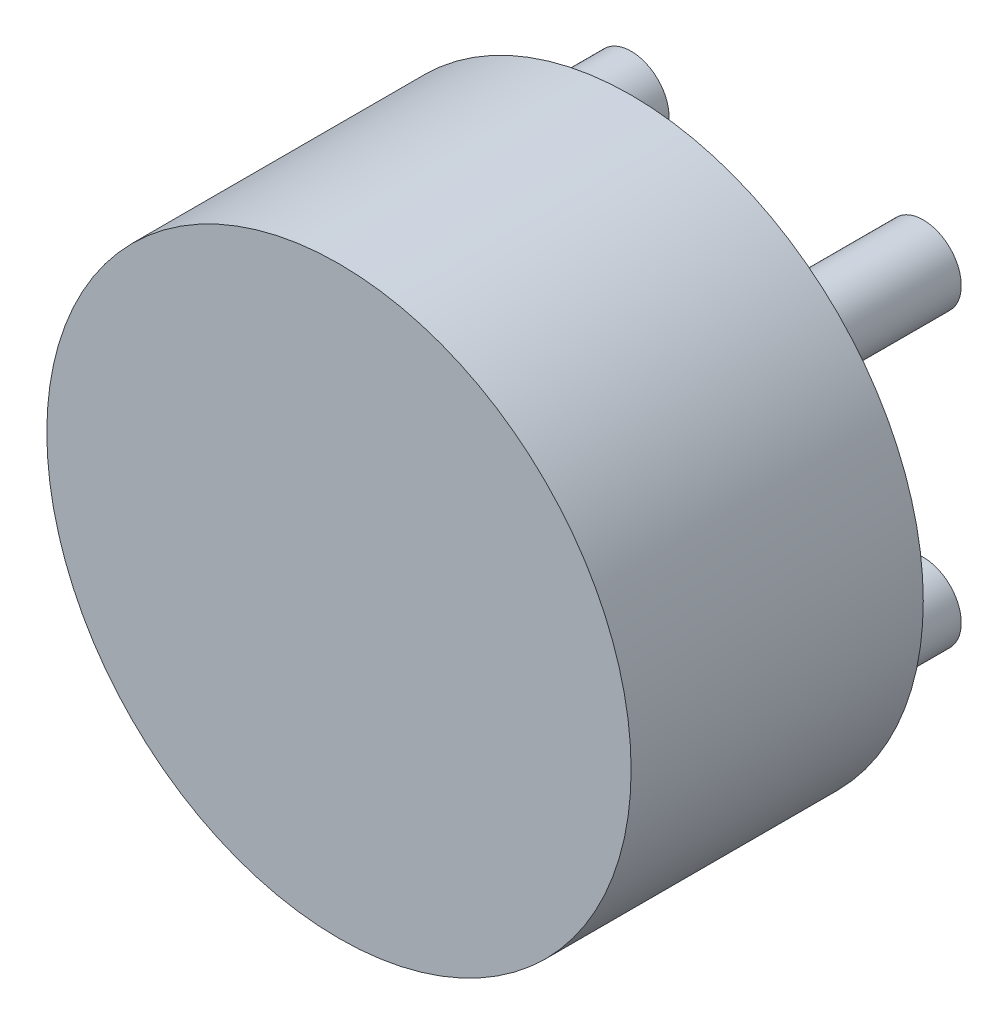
ISO-10303-21;
HEADER;
FILE_DESCRIPTION(('STEP AP214'),'2;1');
FILE_NAME('part.step','',(''),(''),'','','');
FILE_SCHEMA(('AUTOMOTIVE_DESIGN { 1 0 10303 214 1 1 1 1 }'));
ENDSEC;
DATA;
#1=APPLICATION_CONTEXT('core data for automotive mechanical design processes');
#2=APPLICATION_PROTOCOL_DEFINITION('international standard','automotive_design',2000,#1);
#3=PRODUCT_CONTEXT('',#1,'mechanical');
#4=PRODUCT('Part','Part','',(#3));
#5=PRODUCT_RELATED_PRODUCT_CATEGORY('part','',(#4));
#6=PRODUCT_DEFINITION_FORMATION('','',#4);
#7=PRODUCT_DEFINITION_CONTEXT('part definition',#1,'design');
#8=PRODUCT_DEFINITION('design','',#6,#7);
#9=PRODUCT_DEFINITION_SHAPE('','',#8);
#10=(LENGTH_UNIT() NAMED_UNIT(*) SI_UNIT(.MILLI.,.METRE.));
#11=(NAMED_UNIT(*) PLANE_ANGLE_UNIT() SI_UNIT($,.RADIAN.));
#12=(NAMED_UNIT(*) SI_UNIT($,.STERADIAN.) SOLID_ANGLE_UNIT());
#13=UNCERTAINTY_MEASURE_WITH_UNIT(LENGTH_MEASURE(1.E-05),#10,'distance_accuracy_value','');
#14=(GEOMETRIC_REPRESENTATION_CONTEXT(3) GLOBAL_UNCERTAINTY_ASSIGNED_CONTEXT((#13)) GLOBAL_UNIT_ASSIGNED_CONTEXT((#10,
#11,#12)) REPRESENTATION_CONTEXT('',''));
#15=CARTESIAN_POINT('',(0.,0.,0.));
#16=DIRECTION('',(0.,0.,1.));
#17=DIRECTION('',(1.,0.,0.));
#18=AXIS2_PLACEMENT_3D('',#15,#16,#17);
#19=CARTESIAN_POINT('',(-2.54,-2.54,-2.54));
#20=DIRECTION('',(0.,0.,1.));
#21=DIRECTION('',(1.,0.,0.));
#22=AXIS2_PLACEMENT_3D('',#19,#20,#21);
#23=CYLINDRICAL_SURFACE('',#22,0.6604);
#24=CARTESIAN_POINT('',(-2.54,-2.54,-2.54));
#25=DIRECTION('',(0.,0.,-1.));
#26=DIRECTION('',(-1.,0.,0.));
#27=AXIS2_PLACEMENT_3D('',#24,#25,#26);
#28=CIRCLE('',#27,0.6604);
#29=CARTESIAN_POINT('',(-3.2004,-2.54,-2.54));
#30=VERTEX_POINT('',#29);
#31=EDGE_CURVE('E11',#30,#30,#28,.T.);
#32=ORIENTED_EDGE('',*,*,#31,.F.);
#33=EDGE_LOOP('',(#32));
#34=FACE_BOUND('',#33,.T.);
#35=CARTESIAN_POINT('',(-2.54,-2.54,0.));
#36=DIRECTION('',(0.,0.,-1.));
#37=DIRECTION('',(-1.,0.,0.));
#38=AXIS2_PLACEMENT_3D('',#35,#36,#37);
#39=CIRCLE('',#38,0.6604);
#40=CARTESIAN_POINT('',(-3.2004,-2.54,0.));
#41=VERTEX_POINT('',#40);
#42=EDGE_CURVE('E41',#41,#41,#39,.T.);
#43=ORIENTED_EDGE('',*,*,#42,.T.);
#44=EDGE_LOOP('',(#43));
#45=FACE_BOUND('',#44,.T.);
#46=ADVANCED_FACE('F38',(#34,#45),#23,.T.);
#47=CARTESIAN_POINT('',(-2.54,-2.54,-2.54));
#48=DIRECTION('',(0.,0.,-1.));
#49=DIRECTION('',(-1.,0.,0.));
#50=AXIS2_PLACEMENT_3D('',#47,#48,#49);
#51=PLANE('',#50);
#52=ORIENTED_EDGE('',*,*,#31,.T.);
#53=EDGE_LOOP('',(#52));
#54=FACE_BOUND('',#53,.T.);
#55=ADVANCED_FACE('F53',(#54),#51,.T.);
#56=CARTESIAN_POINT('',(-2.54,-2.54,0.));
#57=DIRECTION('',(0.,0.,-1.));
#58=DIRECTION('',(-1.,0.,0.));
#59=AXIS2_PLACEMENT_3D('',#56,#57,#58);
#60=PLANE('',#59);
#61=ORIENTED_EDGE('',*,*,#42,.F.);
#62=EDGE_LOOP('',(#61));
#63=FACE_BOUND('',#62,.T.);
#64=ADVANCED_FACE('F51',(#63),#60,.F.);
#65=CLOSED_SHELL('',(#46,#55,#64));
#66=MANIFOLD_SOLID_BREP('B2',#65);
#67=CARTESIAN_POINT('',(2.54,-2.54,-2.54));
#68=DIRECTION('',(0.,0.,1.));
#69=DIRECTION('',(1.,0.,0.));
#70=AXIS2_PLACEMENT_3D('',#67,#68,#69);
#71=CYLINDRICAL_SURFACE('',#70,0.6604);
#72=CARTESIAN_POINT('',(2.54,-2.54,-2.54));
#73=DIRECTION('',(0.,0.,-1.));
#74=DIRECTION('',(-1.,0.,0.));
#75=AXIS2_PLACEMENT_3D('',#72,#73,#74);
#76=CIRCLE('',#75,0.6604);
#77=CARTESIAN_POINT('',(1.8796,-2.54,-2.54));
#78=VERTEX_POINT('',#77);
#79=EDGE_CURVE('E37',#78,#78,#76,.T.);
#80=ORIENTED_EDGE('',*,*,#79,.F.);
#81=EDGE_LOOP('',(#80));
#82=FACE_BOUND('',#81,.T.);
#83=CARTESIAN_POINT('',(2.54,-2.54,0.));
#84=DIRECTION('',(0.,0.,-1.));
#85=DIRECTION('',(-1.,0.,0.));
#86=AXIS2_PLACEMENT_3D('',#83,#84,#85);
#87=CIRCLE('',#86,0.6604);
#88=CARTESIAN_POINT('',(1.8796,-2.54,0.));
#89=VERTEX_POINT('',#88);
#90=EDGE_CURVE('E90',#89,#89,#87,.T.);
#91=ORIENTED_EDGE('',*,*,#90,.T.);
#92=EDGE_LOOP('',(#91));
#93=FACE_BOUND('',#92,.T.);
#94=ADVANCED_FACE('F87',(#82,#93),#71,.T.);
#95=CARTESIAN_POINT('',(2.54,-2.54,-2.54));
#96=DIRECTION('',(0.,0.,-1.));
#97=DIRECTION('',(-1.,0.,0.));
#98=AXIS2_PLACEMENT_3D('',#95,#96,#97);
#99=PLANE('',#98);
#100=ORIENTED_EDGE('',*,*,#79,.T.);
#101=EDGE_LOOP('',(#100));
#102=FACE_BOUND('',#101,.T.);
#103=ADVANCED_FACE('F102',(#102),#99,.T.);
#104=CARTESIAN_POINT('',(2.54,-2.54,0.));
#105=DIRECTION('',(0.,0.,-1.));
#106=DIRECTION('',(-1.,0.,0.));
#107=AXIS2_PLACEMENT_3D('',#104,#105,#106);
#108=PLANE('',#107);
#109=ORIENTED_EDGE('',*,*,#90,.F.);
#110=EDGE_LOOP('',(#109));
#111=FACE_BOUND('',#110,.T.);
#112=ADVANCED_FACE('F100',(#111),#108,.F.);
#113=CLOSED_SHELL('',(#94,#103,#112));
#114=MANIFOLD_SOLID_BREP('B6',#113);
#115=CARTESIAN_POINT('',(2.54,2.54,-2.54));
#116=DIRECTION('',(0.,0.,1.));
#117=DIRECTION('',(1.,0.,0.));
#118=AXIS2_PLACEMENT_3D('',#115,#116,#117);
#119=CYLINDRICAL_SURFACE('',#118,0.6604);
#120=CARTESIAN_POINT('',(2.54,2.54,-2.54));
#121=DIRECTION('',(0.,0.,-1.));
#122=DIRECTION('',(-1.,0.,0.));
#123=AXIS2_PLACEMENT_3D('',#120,#121,#122);
#124=CIRCLE('',#123,0.6604);
#125=CARTESIAN_POINT('',(1.8796,2.54,-2.54));
#126=VERTEX_POINT('',#125);
#127=EDGE_CURVE('E86',#126,#126,#124,.T.);
#128=ORIENTED_EDGE('',*,*,#127,.F.);
#129=EDGE_LOOP('',(#128));
#130=FACE_BOUND('',#129,.T.);
#131=CARTESIAN_POINT('',(2.54,2.54,0.));
#132=DIRECTION('',(0.,0.,-1.));
#133=DIRECTION('',(-1.,0.,0.));
#134=AXIS2_PLACEMENT_3D('',#131,#132,#133);
#135=CIRCLE('',#134,0.6604);
#136=CARTESIAN_POINT('',(1.8796,2.54,0.));
#137=VERTEX_POINT('',#136);
#138=EDGE_CURVE('E139',#137,#137,#135,.T.);
#139=ORIENTED_EDGE('',*,*,#138,.T.);
#140=EDGE_LOOP('',(#139));
#141=FACE_BOUND('',#140,.T.);
#142=ADVANCED_FACE('F136',(#130,#141),#119,.T.);
#143=CARTESIAN_POINT('',(2.54,2.54,-2.54));
#144=DIRECTION('',(0.,0.,-1.));
#145=DIRECTION('',(-1.,0.,0.));
#146=AXIS2_PLACEMENT_3D('',#143,#144,#145);
#147=PLANE('',#146);
#148=ORIENTED_EDGE('',*,*,#127,.T.);
#149=EDGE_LOOP('',(#148));
#150=FACE_BOUND('',#149,.T.);
#151=ADVANCED_FACE('F151',(#150),#147,.T.);
#152=CARTESIAN_POINT('',(2.54,2.54,0.));
#153=DIRECTION('',(0.,0.,-1.));
#154=DIRECTION('',(-1.,0.,0.));
#155=AXIS2_PLACEMENT_3D('',#152,#153,#154);
#156=PLANE('',#155);
#157=ORIENTED_EDGE('',*,*,#138,.F.);
#158=EDGE_LOOP('',(#157));
#159=FACE_BOUND('',#158,.T.);
#160=ADVANCED_FACE('F149',(#159),#156,.F.);
#161=CLOSED_SHELL('',(#142,#151,#160));
#162=MANIFOLD_SOLID_BREP('B32',#161);
#163=CARTESIAN_POINT('',(-2.54,2.54,-2.54));
#164=DIRECTION('',(0.,0.,1.));
#165=DIRECTION('',(1.,0.,0.));
#166=AXIS2_PLACEMENT_3D('',#163,#164,#165);
#167=CYLINDRICAL_SURFACE('',#166,0.6604);
#168=CARTESIAN_POINT('',(-2.54,2.54,-2.54));
#169=DIRECTION('',(0.,0.,-1.));
#170=DIRECTION('',(-1.,0.,0.));
#171=AXIS2_PLACEMENT_3D('',#168,#169,#170);
#172=CIRCLE('',#171,0.6604);
#173=CARTESIAN_POINT('',(-3.2004,2.54,-2.54));
#174=VERTEX_POINT('',#173);
#175=EDGE_CURVE('E135',#174,#174,#172,.T.);
#176=ORIENTED_EDGE('',*,*,#175,.F.);
#177=EDGE_LOOP('',(#176));
#178=FACE_BOUND('',#177,.T.);
#179=CARTESIAN_POINT('',(-2.54,2.54,0.));
#180=DIRECTION('',(0.,0.,-1.));
#181=DIRECTION('',(-1.,0.,0.));
#182=AXIS2_PLACEMENT_3D('',#179,#180,#181);
#183=CIRCLE('',#182,0.6604);
#184=CARTESIAN_POINT('',(-3.2004,2.54,0.));
#185=VERTEX_POINT('',#184);
#186=EDGE_CURVE('E187',#185,#185,#183,.T.);
#187=ORIENTED_EDGE('',*,*,#186,.T.);
#188=EDGE_LOOP('',(#187));
#189=FACE_BOUND('',#188,.T.);
#190=ADVANCED_FACE('F184',(#178,#189),#167,.T.);
#191=CARTESIAN_POINT('',(-2.54,2.54,-2.54));
#192=DIRECTION('',(0.,0.,-1.));
#193=DIRECTION('',(-1.,0.,0.));
#194=AXIS2_PLACEMENT_3D('',#191,#192,#193);
#195=PLANE('',#194);
#196=ORIENTED_EDGE('',*,*,#175,.T.);
#197=EDGE_LOOP('',(#196));
#198=FACE_BOUND('',#197,.T.);
#199=ADVANCED_FACE('F199',(#198),#195,.T.);
#200=CARTESIAN_POINT('',(-2.54,2.54,0.));
#201=DIRECTION('',(0.,0.,-1.));
#202=DIRECTION('',(-1.,0.,0.));
#203=AXIS2_PLACEMENT_3D('',#200,#201,#202);
#204=PLANE('',#203);
#205=ORIENTED_EDGE('',*,*,#186,.F.);
#206=EDGE_LOOP('',(#205));
#207=FACE_BOUND('',#206,.T.);
#208=ADVANCED_FACE('F197',(#207),#204,.F.);
#209=CLOSED_SHELL('',(#190,#199,#208));
#210=MANIFOLD_SOLID_BREP('B81',#209);
#211=CARTESIAN_POINT('',(0.,0.,5.08));
#212=DIRECTION('',(0.,0.,-1.));
#213=DIRECTION('',(-1.,0.,0.));
#214=AXIS2_PLACEMENT_3D('',#211,#212,#213);
#215=CYLINDRICAL_SURFACE('',#214,5.08);
#216=CARTESIAN_POINT('',(0.,0.,5.08));
#217=DIRECTION('',(0.,0.,1.));
#218=DIRECTION('',(1.,0.,0.));
#219=AXIS2_PLACEMENT_3D('',#216,#217,#218);
#220=CIRCLE('',#219,5.08);
#221=CARTESIAN_POINT('',(5.08,0.,5.08));
#222=VERTEX_POINT('',#221);
#223=EDGE_CURVE('E183',#222,#222,#220,.T.);
#224=ORIENTED_EDGE('',*,*,#223,.F.);
#225=EDGE_LOOP('',(#224));
#226=FACE_BOUND('',#225,.T.);
#227=CARTESIAN_POINT('',(0.,0.,0.));
#228=DIRECTION('',(0.,0.,1.));
#229=DIRECTION('',(1.,0.,0.));
#230=AXIS2_PLACEMENT_3D('',#227,#228,#229);
#231=CIRCLE('',#230,5.08);
#232=CARTESIAN_POINT('',(5.08,0.,0.));
#233=VERTEX_POINT('',#232);
#234=EDGE_CURVE('E228',#233,#233,#231,.T.);
#235=ORIENTED_EDGE('',*,*,#234,.T.);
#236=EDGE_LOOP('',(#235));
#237=FACE_BOUND('',#236,.T.);
#238=ADVANCED_FACE('F225',(#226,#237),#215,.T.);
#239=CARTESIAN_POINT('',(0.,0.,5.08));
#240=DIRECTION('',(0.,0.,1.));
#241=DIRECTION('',(1.,0.,0.));
#242=AXIS2_PLACEMENT_3D('',#239,#240,#241);
#243=PLANE('',#242);
#244=ORIENTED_EDGE('',*,*,#223,.T.);
#245=EDGE_LOOP('',(#244));
#246=FACE_BOUND('',#245,.T.);
#247=ADVANCED_FACE('F240',(#246),#243,.T.);
#248=CARTESIAN_POINT('',(0.,0.,0.));
#249=DIRECTION('',(0.,0.,1.));
#250=DIRECTION('',(1.,0.,0.));
#251=AXIS2_PLACEMENT_3D('',#248,#249,#250);
#252=PLANE('',#251);
#253=ORIENTED_EDGE('',*,*,#234,.F.);
#254=EDGE_LOOP('',(#253));
#255=FACE_BOUND('',#254,.T.);
#256=ADVANCED_FACE('F238',(#255),#252,.F.);
#257=CLOSED_SHELL('',(#238,#247,#256));
#258=MANIFOLD_SOLID_BREP('B130',#257);
#259=ADVANCED_BREP_SHAPE_REPRESENTATION('',(#18,#66,#114,#162,#210,#258),#14);
#260=SHAPE_DEFINITION_REPRESENTATION(#9,#259);
ENDSEC;
END-ISO-10303-21;
